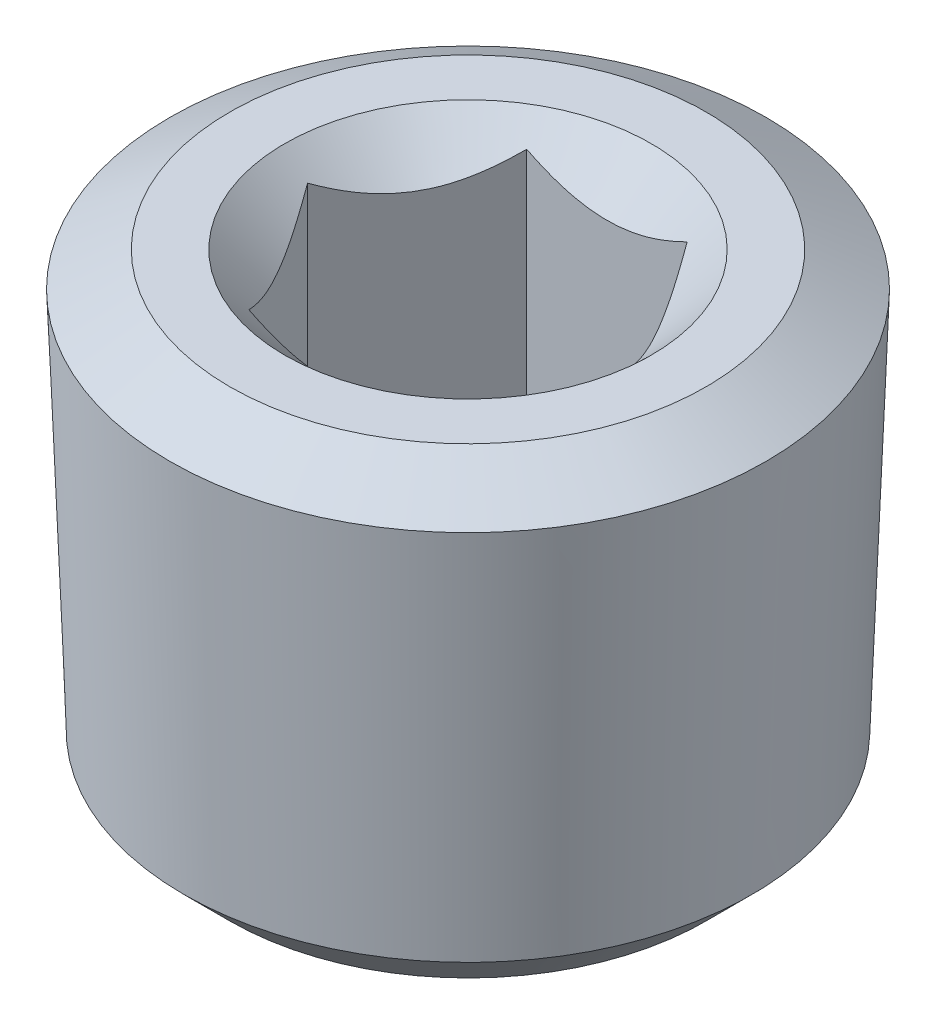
from build123d import *

# Parameters (mm, degrees)
CUT_EXTRUDE1_START = -6.35
CUT_EXTRUDE1_DEPTH = 5.957364


with BuildPart() as part:
    # Sketch2 → Revolve1 (revolve)
    with BuildSketch(Plane.XY, mode=Mode.PRIVATE) as revolve1_sk:
        Polygon((0, 0), (-4.091646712, 0), (-5.121815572, -0.594768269), (-4.882479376, -7.159367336), (-4.091646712, -7.9502), (0, -7.9502), align=None)
    revolve(revolve1_sk.sketch.rotate(Axis((0, 10.744282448, 0), (0, -1, 0)), 270), axis=Axis((0, 10.744282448, 0), (0, -1, 0)))

    # Sketch3 → Cut-Revolve1 (revolve, cut)
    with BuildSketch(Plane.XY, mode=Mode.PRIVATE) as cut_revolve1_sk:
        Polygon((0, 0), (-3.1496, 0), (-2.3876, -0.762), (-2.3876, -6.35), (-1.964873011, -6.604), (0, -6.604), align=None)
    revolve(cut_revolve1_sk.sketch.rotate(Axis((0, 2.934222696, 0), (0, -1, 0)), 270), axis=Axis((0, 2.934222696, 0), (0, -1, 0)), mode=Mode.SUBTRACT)

    # Sketch4 → Cut-Extrude1 (cut)
    with BuildSketch(Plane(origin=(0, 0, 0), x_dir=(1, 0, 0), z_dir=(0, 1, 0)).offset(CUT_EXTRUDE1_START)):
        Polygon((-1.378481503, -2.3876), (1.378481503, -2.3876), (2.756963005, 0), (1.378481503, 2.3876), (-1.378481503, 2.3876), (-2.756963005, 0), align=None)
    extrude(amount=CUT_EXTRUDE1_DEPTH, mode=Mode.SUBTRACT)


solid = part.part
